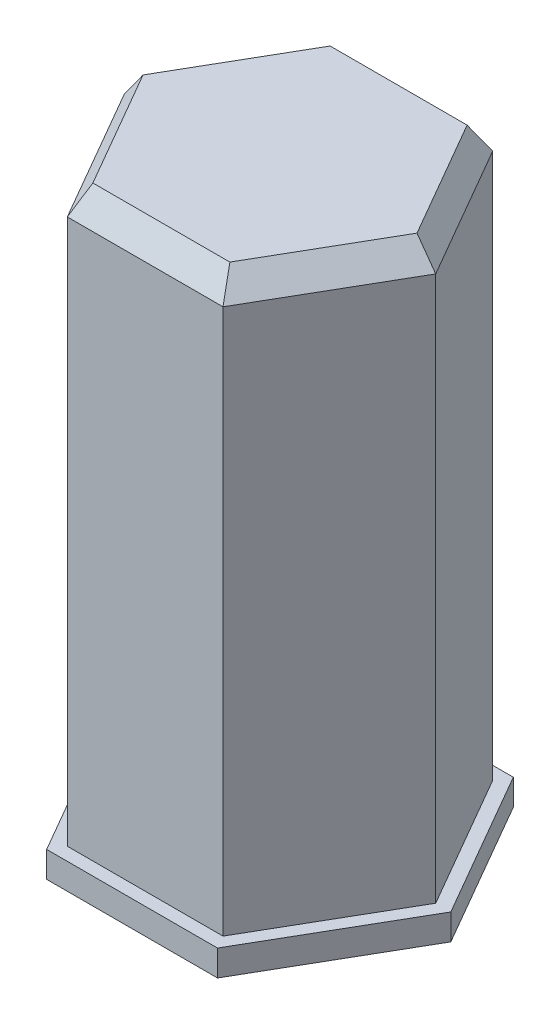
ISO-10303-21;
HEADER;
FILE_DESCRIPTION(('STEP AP214'),'2;1');
FILE_NAME('part.step','',(''),(''),'','','');
FILE_SCHEMA(('AUTOMOTIVE_DESIGN { 1 0 10303 214 1 1 1 1 }'));
ENDSEC;
DATA;
#1=APPLICATION_CONTEXT('core data for automotive mechanical design processes');
#2=APPLICATION_PROTOCOL_DEFINITION('international standard','automotive_design',2000,#1);
#3=PRODUCT_CONTEXT('',#1,'mechanical');
#4=PRODUCT('Part','Part','',(#3));
#5=PRODUCT_RELATED_PRODUCT_CATEGORY('part','',(#4));
#6=PRODUCT_DEFINITION_FORMATION('','',#4);
#7=PRODUCT_DEFINITION_CONTEXT('part definition',#1,'design');
#8=PRODUCT_DEFINITION('design','',#6,#7);
#9=PRODUCT_DEFINITION_SHAPE('','',#8);
#10=(LENGTH_UNIT() NAMED_UNIT(*) SI_UNIT(.MILLI.,.METRE.));
#11=(NAMED_UNIT(*) PLANE_ANGLE_UNIT() SI_UNIT($,.RADIAN.));
#12=(NAMED_UNIT(*) SI_UNIT($,.STERADIAN.) SOLID_ANGLE_UNIT());
#13=UNCERTAINTY_MEASURE_WITH_UNIT(LENGTH_MEASURE(1.E-05),#10,'distance_accuracy_value','');
#14=(GEOMETRIC_REPRESENTATION_CONTEXT(3) GLOBAL_UNCERTAINTY_ASSIGNED_CONTEXT((#13)) GLOBAL_UNIT_ASSIGNED_CONTEXT((#10,
#11,#12)) REPRESENTATION_CONTEXT('',''));
#15=CARTESIAN_POINT('',(0.,0.,0.));
#16=DIRECTION('',(0.,0.,1.));
#17=DIRECTION('',(1.,0.,0.));
#18=AXIS2_PLACEMENT_3D('',#15,#16,#17);
#19=CARTESIAN_POINT('',(0.,1.,0.));
#20=DIRECTION('',(0.,1.,0.));
#21=DIRECTION('',(0.,0.,1.));
#22=AXIS2_PLACEMENT_3D('',#19,#20,#21);
#23=PLANE('',#22);
#24=DIRECTION('',(0.5,0.,0.866025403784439));
#25=VECTOR('',#24,1.);
#26=CARTESIAN_POINT('',(4.5,1.,-2.59807621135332));
#27=LINE('',#26,#25);
#28=CARTESIAN_POINT('',(3.,1.,-5.19615242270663));
#29=VERTEX_POINT('',#28);
#30=CARTESIAN_POINT('',(6.,1.,0.));
#31=VERTEX_POINT('',#30);
#32=EDGE_CURVE('E224',#29,#31,#27,.T.);
#33=ORIENTED_EDGE('',*,*,#32,.T.);
#34=DIRECTION('',(-0.5,0.,0.866025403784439));
#35=VECTOR('',#34,1.);
#36=CARTESIAN_POINT('',(4.5,1.,2.59807621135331));
#37=LINE('',#36,#35);
#38=CARTESIAN_POINT('',(3.,1.,5.19615242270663));
#39=VERTEX_POINT('',#38);
#40=EDGE_CURVE('E227',#31,#39,#37,.T.);
#41=ORIENTED_EDGE('',*,*,#40,.T.);
#42=DIRECTION('',(-1.,0.,0.));
#43=VECTOR('',#42,1.);
#44=CARTESIAN_POINT('',(0.,1.,5.19615242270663));
#45=LINE('',#44,#43);
#46=CARTESIAN_POINT('',(-2.99999999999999,1.,5.19615242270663));
#47=VERTEX_POINT('',#46);
#48=EDGE_CURVE('E212',#39,#47,#45,.T.);
#49=ORIENTED_EDGE('',*,*,#48,.T.);
#50=DIRECTION('',(-0.5,0.,-0.866025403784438));
#51=VECTOR('',#50,1.);
#52=CARTESIAN_POINT('',(-4.5,1.,2.59807621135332));
#53=LINE('',#52,#51);
#54=CARTESIAN_POINT('',(-6.,1.,0.));
#55=VERTEX_POINT('',#54);
#56=EDGE_CURVE('E215',#47,#55,#53,.T.);
#57=ORIENTED_EDGE('',*,*,#56,.T.);
#58=DIRECTION('',(0.5,0.,-0.866025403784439));
#59=VECTOR('',#58,1.);
#60=CARTESIAN_POINT('',(-4.5,1.,-2.59807621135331));
#61=LINE('',#60,#59);
#62=CARTESIAN_POINT('',(-3.,1.,-5.19615242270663));
#63=VERTEX_POINT('',#62);
#64=EDGE_CURVE('E218',#55,#63,#61,.T.);
#65=ORIENTED_EDGE('',*,*,#64,.T.);
#66=DIRECTION('',(1.,0.,0.));
#67=VECTOR('',#66,1.);
#68=CARTESIAN_POINT('',(0.,1.,-5.19615242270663));
#69=LINE('',#68,#67);
#70=EDGE_CURVE('E221',#63,#29,#69,.T.);
#71=ORIENTED_EDGE('',*,*,#70,.T.);
#72=EDGE_LOOP('',(#33,#41,#49,#57,#65,#71));
#73=FACE_BOUND('',#72,.T.);
#74=DIRECTION('',(1.,0.,0.));
#75=VECTOR('',#74,1.);
#76=CARTESIAN_POINT('',(0.,1.,5.7));
#77=LINE('',#76,#75);
#78=CARTESIAN_POINT('',(-3.29089653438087,1.,5.7));
#79=VERTEX_POINT('',#78);
#80=CARTESIAN_POINT('',(3.29089653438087,1.,5.7));
#81=VERTEX_POINT('',#80);
#82=EDGE_CURVE('E179',#79,#81,#77,.T.);
#83=ORIENTED_EDGE('',*,*,#82,.T.);
#84=DIRECTION('',(0.5,0.,-0.866025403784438));
#85=VECTOR('',#84,1.);
#86=CARTESIAN_POINT('',(4.9363448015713,1.,2.85));
#87=LINE('',#86,#85);
#88=CARTESIAN_POINT('',(6.58179306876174,1.,0.));
#89=VERTEX_POINT('',#88);
#90=EDGE_CURVE('E196',#81,#89,#87,.T.);
#91=ORIENTED_EDGE('',*,*,#90,.T.);
#92=DIRECTION('',(-0.5,0.,-0.866025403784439));
#93=VECTOR('',#92,1.);
#94=CARTESIAN_POINT('',(4.9363448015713,1.,-2.85));
#95=LINE('',#94,#93);
#96=CARTESIAN_POINT('',(3.29089653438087,1.,-5.7));
#97=VERTEX_POINT('',#96);
#98=EDGE_CURVE('E193',#89,#97,#95,.T.);
#99=ORIENTED_EDGE('',*,*,#98,.T.);
#100=DIRECTION('',(-1.,0.,0.));
#101=VECTOR('',#100,1.);
#102=CARTESIAN_POINT('',(0.,1.,-5.7));
#103=LINE('',#102,#101);
#104=CARTESIAN_POINT('',(-3.29089653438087,1.,-5.7));
#105=VERTEX_POINT('',#104);
#106=EDGE_CURVE('E190',#97,#105,#103,.T.);
#107=ORIENTED_EDGE('',*,*,#106,.T.);
#108=DIRECTION('',(-0.5,0.,0.866025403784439));
#109=VECTOR('',#108,1.);
#110=CARTESIAN_POINT('',(-4.9363448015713,1.,-2.85));
#111=LINE('',#110,#109);
#112=CARTESIAN_POINT('',(-6.58179306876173,1.,0.));
#113=VERTEX_POINT('',#112);
#114=EDGE_CURVE('E188',#105,#113,#111,.T.);
#115=ORIENTED_EDGE('',*,*,#114,.T.);
#116=DIRECTION('',(0.5,0.,0.866025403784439));
#117=VECTOR('',#116,1.);
#118=CARTESIAN_POINT('',(-4.9363448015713,1.,2.85));
#119=LINE('',#118,#117);
#120=EDGE_CURVE('E149',#113,#79,#119,.T.);
#121=ORIENTED_EDGE('',*,*,#120,.T.);
#122=EDGE_LOOP('',(#83,#91,#99,#107,#115,#121));
#123=FACE_BOUND('',#122,.T.);
#124=ADVANCED_FACE('F38',(#73,#123),#23,.T.);
#125=CARTESIAN_POINT('',(3.,23.,5.19615242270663));
#126=DIRECTION('',(-0.866025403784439,0.,-0.5));
#127=DIRECTION('',(-0.5,0.,0.866025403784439));
#128=AXIS2_PLACEMENT_3D('',#125,#126,#127);
#129=PLANE('',#128);
#130=DIRECTION('',(0.,-1.,0.));
#131=VECTOR('',#130,1.);
#132=CARTESIAN_POINT('',(6.,23.,0.));
#133=LINE('',#132,#131);
#134=CARTESIAN_POINT('',(6.,22.,0.));
#135=VERTEX_POINT('',#134);
#136=EDGE_CURVE('E210',#135,#31,#133,.T.);
#137=ORIENTED_EDGE('',*,*,#136,.F.);
#138=DIRECTION('',(-0.5,0.,0.866025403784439));
#139=VECTOR('',#138,1.);
#140=CARTESIAN_POINT('',(3.,22.,5.19615242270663));
#141=LINE('',#140,#139);
#142=CARTESIAN_POINT('',(3.,22.,5.19615242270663));
#143=VERTEX_POINT('',#142);
#144=EDGE_CURVE('E47',#135,#143,#141,.T.);
#145=ORIENTED_EDGE('',*,*,#144,.T.);
#146=DIRECTION('',(0.,-1.,0.));
#147=VECTOR('',#146,1.);
#148=CARTESIAN_POINT('',(3.,23.,5.19615242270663));
#149=LINE('',#148,#147);
#150=EDGE_CURVE('E200',#143,#39,#149,.T.);
#151=ORIENTED_EDGE('',*,*,#150,.T.);
#152=ORIENTED_EDGE('',*,*,#40,.F.);
#153=EDGE_LOOP('',(#137,#145,#151,#152));
#154=FACE_BOUND('',#153,.T.);
#155=ADVANCED_FACE('F284',(#154),#129,.F.);
#156=CARTESIAN_POINT('',(6.,23.,0.));
#157=DIRECTION('',(-0.866025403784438,0.,0.5));
#158=DIRECTION('',(0.5,0.,0.866025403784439));
#159=AXIS2_PLACEMENT_3D('',#156,#157,#158);
#160=PLANE('',#159);
#161=DIRECTION('',(0.,-1.,0.));
#162=VECTOR('',#161,1.);
#163=CARTESIAN_POINT('',(3.,23.,-5.19615242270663));
#164=LINE('',#163,#162);
#165=CARTESIAN_POINT('',(3.,22.,-5.19615242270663));
#166=VERTEX_POINT('',#165);
#167=EDGE_CURVE('E208',#166,#29,#164,.T.);
#168=ORIENTED_EDGE('',*,*,#167,.F.);
#169=DIRECTION('',(0.5,0.,0.866025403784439));
#170=VECTOR('',#169,1.);
#171=CARTESIAN_POINT('',(6.,22.,0.));
#172=LINE('',#171,#170);
#173=EDGE_CURVE('E250',#166,#135,#172,.T.);
#174=ORIENTED_EDGE('',*,*,#173,.T.);
#175=ORIENTED_EDGE('',*,*,#136,.T.);
#176=ORIENTED_EDGE('',*,*,#32,.F.);
#177=EDGE_LOOP('',(#168,#174,#175,#176));
#178=FACE_BOUND('',#177,.T.);
#179=ADVANCED_FACE('F280',(#178),#160,.F.);
#180=CARTESIAN_POINT('',(3.,23.,-5.19615242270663));
#181=DIRECTION('',(0.,0.,1.));
#182=DIRECTION('',(1.,0.,0.));
#183=AXIS2_PLACEMENT_3D('',#180,#181,#182);
#184=PLANE('',#183);
#185=DIRECTION('',(0.,-1.,0.));
#186=VECTOR('',#185,1.);
#187=CARTESIAN_POINT('',(-3.,23.,-5.19615242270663));
#188=LINE('',#187,#186);
#189=CARTESIAN_POINT('',(-3.,22.,-5.19615242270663));
#190=VERTEX_POINT('',#189);
#191=EDGE_CURVE('E206',#190,#63,#188,.T.);
#192=ORIENTED_EDGE('',*,*,#191,.F.);
#193=DIRECTION('',(1.,0.,0.));
#194=VECTOR('',#193,1.);
#195=CARTESIAN_POINT('',(3.,22.,-5.19615242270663));
#196=LINE('',#195,#194);
#197=EDGE_CURVE('E248',#190,#166,#196,.T.);
#198=ORIENTED_EDGE('',*,*,#197,.T.);
#199=ORIENTED_EDGE('',*,*,#167,.T.);
#200=ORIENTED_EDGE('',*,*,#70,.F.);
#201=EDGE_LOOP('',(#192,#198,#199,#200));
#202=FACE_BOUND('',#201,.T.);
#203=ADVANCED_FACE('F293',(#202),#184,.F.);
#204=CARTESIAN_POINT('',(-3.,23.,-5.19615242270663));
#205=DIRECTION('',(0.866025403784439,0.,0.5));
#206=DIRECTION('',(0.5,0.,-0.866025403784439));
#207=AXIS2_PLACEMENT_3D('',#204,#205,#206);
#208=PLANE('',#207);
#209=DIRECTION('',(0.,-1.,0.));
#210=VECTOR('',#209,1.);
#211=CARTESIAN_POINT('',(-6.,23.,0.));
#212=LINE('',#211,#210);
#213=CARTESIAN_POINT('',(-6.,22.,0.));
#214=VERTEX_POINT('',#213);
#215=EDGE_CURVE('E204',#214,#55,#212,.T.);
#216=ORIENTED_EDGE('',*,*,#215,.F.);
#217=DIRECTION('',(0.5,0.,-0.866025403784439));
#218=VECTOR('',#217,1.);
#219=CARTESIAN_POINT('',(-3.,22.,-5.19615242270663));
#220=LINE('',#219,#218);
#221=EDGE_CURVE('E246',#214,#190,#220,.T.);
#222=ORIENTED_EDGE('',*,*,#221,.T.);
#223=ORIENTED_EDGE('',*,*,#191,.T.);
#224=ORIENTED_EDGE('',*,*,#64,.F.);
#225=EDGE_LOOP('',(#216,#222,#223,#224));
#226=FACE_BOUND('',#225,.T.);
#227=ADVANCED_FACE('F296',(#226),#208,.F.);
#228=CARTESIAN_POINT('',(-6.,23.,0.));
#229=DIRECTION('',(0.866025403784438,0.,-0.5));
#230=DIRECTION('',(-0.5,0.,-0.866025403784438));
#231=AXIS2_PLACEMENT_3D('',#228,#229,#230);
#232=PLANE('',#231);
#233=DIRECTION('',(0.,-1.,0.));
#234=VECTOR('',#233,1.);
#235=CARTESIAN_POINT('',(-2.99999999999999,23.,5.19615242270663));
#236=LINE('',#235,#234);
#237=CARTESIAN_POINT('',(-2.99999999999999,22.,5.19615242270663));
#238=VERTEX_POINT('',#237);
#239=EDGE_CURVE('E202',#238,#47,#236,.T.);
#240=ORIENTED_EDGE('',*,*,#239,.F.);
#241=DIRECTION('',(-0.5,0.,-0.866025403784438));
#242=VECTOR('',#241,1.);
#243=CARTESIAN_POINT('',(-6.,22.,0.));
#244=LINE('',#243,#242);
#245=EDGE_CURVE('E243',#238,#214,#244,.T.);
#246=ORIENTED_EDGE('',*,*,#245,.T.);
#247=ORIENTED_EDGE('',*,*,#215,.T.);
#248=ORIENTED_EDGE('',*,*,#56,.F.);
#249=EDGE_LOOP('',(#240,#246,#247,#248));
#250=FACE_BOUND('',#249,.T.);
#251=ADVANCED_FACE('F306',(#250),#232,.F.);
#252=CARTESIAN_POINT('',(-2.99999999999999,23.,5.19615242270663));
#253=DIRECTION('',(0.,0.,-1.));
#254=DIRECTION('',(-1.,0.,0.));
#255=AXIS2_PLACEMENT_3D('',#252,#253,#254);
#256=PLANE('',#255);
#257=ORIENTED_EDGE('',*,*,#150,.F.);
#258=DIRECTION('',(-1.,0.,0.));
#259=VECTOR('',#258,1.);
#260=CARTESIAN_POINT('',(-2.99999999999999,22.,5.19615242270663));
#261=LINE('',#260,#259);
#262=EDGE_CURVE('E12',#143,#238,#261,.T.);
#263=ORIENTED_EDGE('',*,*,#262,.T.);
#264=ORIENTED_EDGE('',*,*,#239,.T.);
#265=ORIENTED_EDGE('',*,*,#48,.F.);
#266=EDGE_LOOP('',(#257,#263,#264,#265));
#267=FACE_BOUND('',#266,.T.);
#268=ADVANCED_FACE('F417',(#267),#256,.F.);
#269=CARTESIAN_POINT('',(0.,23.,0.));
#270=DIRECTION('',(0.,1.,0.));
#271=DIRECTION('',(0.,0.,1.));
#272=AXIS2_PLACEMENT_3D('',#269,#270,#271);
#273=PLANE('',#272);
#274=DIRECTION('',(-0.5,0.,0.866025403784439));
#275=VECTOR('',#274,1.);
#276=CARTESIAN_POINT('',(-5.4588472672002,23.,0.312434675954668));
#277=LINE('',#276,#275);
#278=CARTESIAN_POINT('',(-2.6392315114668,23.,-4.5712830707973));
#279=VERTEX_POINT('',#278);
#280=CARTESIAN_POINT('',(-5.2784630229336,23.,0.));
#281=VERTEX_POINT('',#280);
#282=EDGE_CURVE('E238',#279,#281,#277,.T.);
#283=ORIENTED_EDGE('',*,*,#282,.T.);
#284=DIRECTION('',(0.5,0.,0.866025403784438));
#285=VECTOR('',#284,1.);
#286=CARTESIAN_POINT('',(-2.4588472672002,23.,4.88371774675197));
#287=LINE('',#286,#285);
#288=CARTESIAN_POINT('',(-2.6392315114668,23.,4.5712830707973));
#289=VERTEX_POINT('',#288);
#290=EDGE_CURVE('E240',#281,#289,#287,.T.);
#291=ORIENTED_EDGE('',*,*,#290,.T.);
#292=DIRECTION('',(1.,0.,0.));
#293=VECTOR('',#292,1.);
#294=CARTESIAN_POINT('',(3.,23.,4.5712830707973));
#295=LINE('',#294,#293);
#296=CARTESIAN_POINT('',(2.6392315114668,23.,4.5712830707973));
#297=VERTEX_POINT('',#296);
#298=EDGE_CURVE('E230',#289,#297,#295,.T.);
#299=ORIENTED_EDGE('',*,*,#298,.T.);
#300=DIRECTION('',(0.5,0.,-0.866025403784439));
#301=VECTOR('',#300,1.);
#302=CARTESIAN_POINT('',(5.4588472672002,23.,-0.312434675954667));
#303=LINE('',#302,#301);
#304=CARTESIAN_POINT('',(5.2784630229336,23.,0.));
#305=VERTEX_POINT('',#304);
#306=EDGE_CURVE('E232',#297,#305,#303,.T.);
#307=ORIENTED_EDGE('',*,*,#306,.T.);
#308=DIRECTION('',(-0.5,0.,-0.866025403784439));
#309=VECTOR('',#308,1.);
#310=CARTESIAN_POINT('',(2.4588472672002,23.,-4.88371774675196));
#311=LINE('',#310,#309);
#312=CARTESIAN_POINT('',(2.6392315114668,23.,-4.5712830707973));
#313=VERTEX_POINT('',#312);
#314=EDGE_CURVE('E234',#305,#313,#311,.T.);
#315=ORIENTED_EDGE('',*,*,#314,.T.);
#316=DIRECTION('',(-1.,0.,0.));
#317=VECTOR('',#316,1.);
#318=CARTESIAN_POINT('',(-3.,23.,-4.5712830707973));
#319=LINE('',#318,#317);
#320=EDGE_CURVE('E236',#313,#279,#319,.T.);
#321=ORIENTED_EDGE('',*,*,#320,.T.);
#322=EDGE_LOOP('',(#283,#291,#299,#307,#315,#321));
#323=FACE_BOUND('',#322,.T.);
#324=ADVANCED_FACE('F317',(#323),#273,.T.);
#325=CARTESIAN_POINT('',(3.9588472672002,23.,-2.28564153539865));
#326=DIRECTION('',(0.734431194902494,0.529919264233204,-0.424024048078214));
#327=DIRECTION('',(0.5,0.,0.866025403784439));
#328=AXIS2_PLACEMENT_3D('',#325,#326,#327);
#329=PLANE('',#328);
#330=DIRECTION('',(-0.5851252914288,0.810942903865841,0.));
#331=VECTOR('',#330,1.);
#332=CARTESIAN_POINT('',(4.82666405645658,23.6261619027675,0.));
#333=LINE('',#332,#331);
#334=EDGE_CURVE('E261',#135,#305,#333,.T.);
#335=ORIENTED_EDGE('',*,*,#334,.F.);
#336=ORIENTED_EDGE('',*,*,#173,.F.);
#337=DIRECTION('',(-0.2925626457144,0.810942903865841,0.506733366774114));
#338=VECTOR('',#337,1.);
#339=CARTESIAN_POINT('',(2.41333202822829,23.6261619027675,-4.18001368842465));
#340=LINE('',#339,#338);
#341=EDGE_CURVE('E42',#313,#166,#340,.F.);
#342=ORIENTED_EDGE('',*,*,#341,.F.);
#343=ORIENTED_EDGE('',*,*,#314,.F.);
#344=EDGE_LOOP('',(#335,#336,#342,#343));
#345=FACE_BOUND('',#344,.T.);
#346=ADVANCED_FACE('F40',(#345),#329,.T.);
#347=CARTESIAN_POINT('',(0.,23.,-4.5712830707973));
#348=DIRECTION('',(0.,0.529919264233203,-0.848048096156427));
#349=DIRECTION('',(1.,0.,0.));
#350=AXIS2_PLACEMENT_3D('',#347,#348,#349);
#351=PLANE('',#350);
#352=ORIENTED_EDGE('',*,*,#341,.T.);
#353=ORIENTED_EDGE('',*,*,#197,.F.);
#354=DIRECTION('',(0.2925626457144,0.810942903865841,0.506733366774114));
#355=VECTOR('',#354,1.);
#356=CARTESIAN_POINT('',(-2.41333202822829,23.6261619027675,-4.18001368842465));
#357=LINE('',#356,#355);
#358=EDGE_CURVE('E259',#279,#190,#357,.F.);
#359=ORIENTED_EDGE('',*,*,#358,.F.);
#360=ORIENTED_EDGE('',*,*,#320,.F.);
#361=EDGE_LOOP('',(#352,#353,#359,#360));
#362=FACE_BOUND('',#361,.T.);
#363=ADVANCED_FACE('F272',(#362),#351,.T.);
#364=CARTESIAN_POINT('',(3.9588472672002,23.,2.28564153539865));
#365=DIRECTION('',(0.734431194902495,0.529919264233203,0.424024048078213));
#366=DIRECTION('',(-0.5,0.,0.866025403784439));
#367=AXIS2_PLACEMENT_3D('',#364,#365,#366);
#368=PLANE('',#367);
#369=ORIENTED_EDGE('',*,*,#334,.T.);
#370=ORIENTED_EDGE('',*,*,#306,.F.);
#371=DIRECTION('',(-0.2925626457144,0.810942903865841,-0.506733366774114));
#372=VECTOR('',#371,1.);
#373=CARTESIAN_POINT('',(2.41333202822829,23.6261619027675,4.18001368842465));
#374=LINE('',#373,#372);
#375=EDGE_CURVE('E256',#143,#297,#374,.T.);
#376=ORIENTED_EDGE('',*,*,#375,.F.);
#377=ORIENTED_EDGE('',*,*,#144,.F.);
#378=EDGE_LOOP('',(#369,#370,#376,#377));
#379=FACE_BOUND('',#378,.T.);
#380=ADVANCED_FACE('F318',(#379),#368,.T.);
#381=CARTESIAN_POINT('',(-3.9588472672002,23.,-2.28564153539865));
#382=DIRECTION('',(-0.734431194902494,0.529919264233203,-0.424024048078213));
#383=DIRECTION('',(0.5,0.,-0.866025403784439));
#384=AXIS2_PLACEMENT_3D('',#381,#382,#383);
#385=PLANE('',#384);
#386=ORIENTED_EDGE('',*,*,#358,.T.);
#387=ORIENTED_EDGE('',*,*,#221,.F.);
#388=DIRECTION('',(0.5851252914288,0.810942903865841,0.));
#389=VECTOR('',#388,1.);
#390=CARTESIAN_POINT('',(-4.82666405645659,23.6261619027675,0.));
#391=LINE('',#390,#389);
#392=EDGE_CURVE('E254',#281,#214,#391,.F.);
#393=ORIENTED_EDGE('',*,*,#392,.F.);
#394=ORIENTED_EDGE('',*,*,#282,.F.);
#395=EDGE_LOOP('',(#386,#387,#393,#394));
#396=FACE_BOUND('',#395,.T.);
#397=ADVANCED_FACE('F300',(#396),#385,.T.);
#398=CARTESIAN_POINT('',(0.,23.,4.5712830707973));
#399=DIRECTION('',(0.,0.529919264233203,0.848048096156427));
#400=DIRECTION('',(-1.,0.,0.));
#401=AXIS2_PLACEMENT_3D('',#398,#399,#400);
#402=PLANE('',#401);
#403=ORIENTED_EDGE('',*,*,#375,.T.);
#404=ORIENTED_EDGE('',*,*,#298,.F.);
#405=DIRECTION('',(-0.2925626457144,-0.810942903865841,0.506733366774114));
#406=VECTOR('',#405,1.);
#407=CARTESIAN_POINT('',(-2.41333202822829,23.6261619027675,4.18001368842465));
#408=LINE('',#407,#406);
#409=EDGE_CURVE('E199',#238,#289,#408,.F.);
#410=ORIENTED_EDGE('',*,*,#409,.F.);
#411=ORIENTED_EDGE('',*,*,#262,.F.);
#412=EDGE_LOOP('',(#403,#404,#410,#411));
#413=FACE_BOUND('',#412,.T.);
#414=ADVANCED_FACE('F314',(#413),#402,.T.);
#415=CARTESIAN_POINT('',(-3.9588472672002,23.,2.28564153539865));
#416=DIRECTION('',(-0.734431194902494,0.529919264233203,0.424024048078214));
#417=DIRECTION('',(-0.5,0.,-0.866025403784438));
#418=AXIS2_PLACEMENT_3D('',#415,#416,#417);
#419=PLANE('',#418);
#420=ORIENTED_EDGE('',*,*,#392,.T.);
#421=ORIENTED_EDGE('',*,*,#245,.F.);
#422=ORIENTED_EDGE('',*,*,#409,.T.);
#423=ORIENTED_EDGE('',*,*,#290,.F.);
#424=EDGE_LOOP('',(#420,#421,#422,#423));
#425=FACE_BOUND('',#424,.T.);
#426=ADVANCED_FACE('F310',(#425),#419,.T.);
#427=CARTESIAN_POINT('',(6.58179306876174,23.,0.));
#428=DIRECTION('',(0.866025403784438,0.,0.5));
#429=DIRECTION('',(0.5,0.,-0.866025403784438));
#430=AXIS2_PLACEMENT_3D('',#427,#428,#429);
#431=PLANE('',#430);
#432=DIRECTION('',(0.,-1.,0.));
#433=VECTOR('',#432,1.);
#434=CARTESIAN_POINT('',(3.29089653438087,23.,5.7));
#435=LINE('',#434,#433);
#436=CARTESIAN_POINT('',(3.29089653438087,0.,5.7));
#437=VERTEX_POINT('',#436);
#438=EDGE_CURVE('E55',#81,#437,#435,.T.);
#439=ORIENTED_EDGE('',*,*,#438,.T.);
#440=DIRECTION('',(-0.5,0.,0.866025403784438));
#441=VECTOR('',#440,1.);
#442=CARTESIAN_POINT('',(6.58179306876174,0.,0.));
#443=LINE('',#442,#441);
#444=CARTESIAN_POINT('',(6.58179306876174,0.,0.));
#445=VERTEX_POINT('',#444);
#446=EDGE_CURVE('E169',#445,#437,#443,.T.);
#447=ORIENTED_EDGE('',*,*,#446,.F.);
#448=DIRECTION('',(0.,-1.,0.));
#449=VECTOR('',#448,1.);
#450=CARTESIAN_POINT('',(6.58179306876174,23.,0.));
#451=LINE('',#450,#449);
#452=EDGE_CURVE('E177',#89,#445,#451,.T.);
#453=ORIENTED_EDGE('',*,*,#452,.F.);
#454=ORIENTED_EDGE('',*,*,#90,.F.);
#455=EDGE_LOOP('',(#439,#447,#453,#454));
#456=FACE_BOUND('',#455,.T.);
#457=ADVANCED_FACE('F341',(#456),#431,.T.);
#458=CARTESIAN_POINT('',(3.29089653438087,23.,-5.7));
#459=DIRECTION('',(0.866025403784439,0.,-0.5));
#460=DIRECTION('',(-0.5,0.,-0.866025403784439));
#461=AXIS2_PLACEMENT_3D('',#458,#459,#460);
#462=PLANE('',#461);
#463=ORIENTED_EDGE('',*,*,#452,.T.);
#464=DIRECTION('',(0.5,0.,0.866025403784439));
#465=VECTOR('',#464,1.);
#466=CARTESIAN_POINT('',(3.29089653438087,0.,-5.7));
#467=LINE('',#466,#465);
#468=CARTESIAN_POINT('',(3.29089653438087,0.,-5.7));
#469=VERTEX_POINT('',#468);
#470=EDGE_CURVE('E174',#469,#445,#467,.T.);
#471=ORIENTED_EDGE('',*,*,#470,.F.);
#472=DIRECTION('',(0.,-1.,0.));
#473=VECTOR('',#472,1.);
#474=CARTESIAN_POINT('',(3.29089653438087,23.,-5.7));
#475=LINE('',#474,#473);
#476=EDGE_CURVE('E180',#97,#469,#475,.T.);
#477=ORIENTED_EDGE('',*,*,#476,.F.);
#478=ORIENTED_EDGE('',*,*,#98,.F.);
#479=EDGE_LOOP('',(#463,#471,#477,#478));
#480=FACE_BOUND('',#479,.T.);
#481=ADVANCED_FACE('F365',(#480),#462,.T.);
#482=CARTESIAN_POINT('',(-3.29089653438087,23.,-5.7));
#483=DIRECTION('',(0.,0.,-1.));
#484=DIRECTION('',(-1.,0.,0.));
#485=AXIS2_PLACEMENT_3D('',#482,#483,#484);
#486=PLANE('',#485);
#487=ORIENTED_EDGE('',*,*,#476,.T.);
#488=DIRECTION('',(1.,0.,0.));
#489=VECTOR('',#488,1.);
#490=CARTESIAN_POINT('',(-3.29089653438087,0.,-5.7));
#491=LINE('',#490,#489);
#492=CARTESIAN_POINT('',(-3.29089653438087,0.,-5.7));
#493=VERTEX_POINT('',#492);
#494=EDGE_CURVE('E162',#493,#469,#491,.T.);
#495=ORIENTED_EDGE('',*,*,#494,.F.);
#496=DIRECTION('',(0.,-1.,0.));
#497=VECTOR('',#496,1.);
#498=CARTESIAN_POINT('',(-3.29089653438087,23.,-5.7));
#499=LINE('',#498,#497);
#500=EDGE_CURVE('E152',#105,#493,#499,.T.);
#501=ORIENTED_EDGE('',*,*,#500,.F.);
#502=ORIENTED_EDGE('',*,*,#106,.F.);
#503=EDGE_LOOP('',(#487,#495,#501,#502));
#504=FACE_BOUND('',#503,.T.);
#505=ADVANCED_FACE('F372',(#504),#486,.T.);
#506=CARTESIAN_POINT('',(-6.58179306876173,23.,0.));
#507=DIRECTION('',(-0.866025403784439,0.,-0.5));
#508=DIRECTION('',(-0.5,0.,0.866025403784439));
#509=AXIS2_PLACEMENT_3D('',#506,#507,#508);
#510=PLANE('',#509);
#511=ORIENTED_EDGE('',*,*,#500,.T.);
#512=DIRECTION('',(0.5,0.,-0.866025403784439));
#513=VECTOR('',#512,1.);
#514=CARTESIAN_POINT('',(-6.58179306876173,0.,0.));
#515=LINE('',#514,#513);
#516=CARTESIAN_POINT('',(-6.58179306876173,0.,0.));
#517=VERTEX_POINT('',#516);
#518=EDGE_CURVE('E156',#517,#493,#515,.T.);
#519=ORIENTED_EDGE('',*,*,#518,.F.);
#520=DIRECTION('',(0.,-1.,0.));
#521=VECTOR('',#520,1.);
#522=CARTESIAN_POINT('',(-6.58179306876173,23.,0.));
#523=LINE('',#522,#521);
#524=EDGE_CURVE('E145',#113,#517,#523,.T.);
#525=ORIENTED_EDGE('',*,*,#524,.F.);
#526=ORIENTED_EDGE('',*,*,#114,.F.);
#527=EDGE_LOOP('',(#511,#519,#525,#526));
#528=FACE_BOUND('',#527,.T.);
#529=ADVANCED_FACE('F157',(#528),#510,.T.);
#530=CARTESIAN_POINT('',(-3.29089653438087,23.,5.7));
#531=DIRECTION('',(-0.866025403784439,0.,0.5));
#532=DIRECTION('',(0.5,0.,0.866025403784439));
#533=AXIS2_PLACEMENT_3D('',#530,#531,#532);
#534=PLANE('',#533);
#535=ORIENTED_EDGE('',*,*,#524,.T.);
#536=DIRECTION('',(-0.5,0.,-0.866025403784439));
#537=VECTOR('',#536,1.);
#538=CARTESIAN_POINT('',(-3.29089653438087,0.,5.7));
#539=LINE('',#538,#537);
#540=CARTESIAN_POINT('',(-3.29089653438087,0.,5.7));
#541=VERTEX_POINT('',#540);
#542=EDGE_CURVE('E63',#541,#517,#539,.T.);
#543=ORIENTED_EDGE('',*,*,#542,.F.);
#544=DIRECTION('',(0.,-1.,0.));
#545=VECTOR('',#544,1.);
#546=CARTESIAN_POINT('',(-3.29089653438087,23.,5.7));
#547=LINE('',#546,#545);
#548=EDGE_CURVE('E153',#79,#541,#547,.T.);
#549=ORIENTED_EDGE('',*,*,#548,.F.);
#550=ORIENTED_EDGE('',*,*,#120,.F.);
#551=EDGE_LOOP('',(#535,#543,#549,#550));
#552=FACE_BOUND('',#551,.T.);
#553=ADVANCED_FACE('F147',(#552),#534,.T.);
#554=CARTESIAN_POINT('',(3.29089653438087,23.,5.7));
#555=DIRECTION('',(0.,0.,1.));
#556=DIRECTION('',(1.,0.,0.));
#557=AXIS2_PLACEMENT_3D('',#554,#555,#556);
#558=PLANE('',#557);
#559=ORIENTED_EDGE('',*,*,#548,.T.);
#560=DIRECTION('',(-1.,0.,0.));
#561=VECTOR('',#560,1.);
#562=CARTESIAN_POINT('',(3.29089653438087,0.,5.7));
#563=LINE('',#562,#561);
#564=EDGE_CURVE('E167',#437,#541,#563,.T.);
#565=ORIENTED_EDGE('',*,*,#564,.F.);
#566=ORIENTED_EDGE('',*,*,#438,.F.);
#567=ORIENTED_EDGE('',*,*,#82,.F.);
#568=EDGE_LOOP('',(#559,#565,#566,#567));
#569=FACE_BOUND('',#568,.T.);
#570=ADVANCED_FACE('F338',(#569),#558,.T.);
#571=CARTESIAN_POINT('',(0.,0.,0.));
#572=DIRECTION('',(0.,1.,0.));
#573=DIRECTION('',(0.,0.,1.));
#574=AXIS2_PLACEMENT_3D('',#571,#572,#573);
#575=PLANE('',#574);
#576=ORIENTED_EDGE('',*,*,#446,.T.);
#577=ORIENTED_EDGE('',*,*,#564,.T.);
#578=ORIENTED_EDGE('',*,*,#542,.T.);
#579=ORIENTED_EDGE('',*,*,#518,.T.);
#580=ORIENTED_EDGE('',*,*,#494,.T.);
#581=ORIENTED_EDGE('',*,*,#470,.T.);
#582=EDGE_LOOP('',(#576,#577,#578,#579,#580,#581));
#583=FACE_BOUND('',#582,.T.);
#584=ADVANCED_FACE('F166',(#583),#575,.F.);
#585=CLOSED_SHELL('',(#124,#155,#179,#203,#227,#251,#268,#324,#346,#363,#380,#397,#414,#426,
#457,#481,#505,#529,#553,#570,#584));
#586=MANIFOLD_SOLID_BREP('B2',#585);
#587=ADVANCED_BREP_SHAPE_REPRESENTATION('',(#18,#586),#14);
#588=SHAPE_DEFINITION_REPRESENTATION(#9,#587);
ENDSEC;
END-ISO-10303-21;
